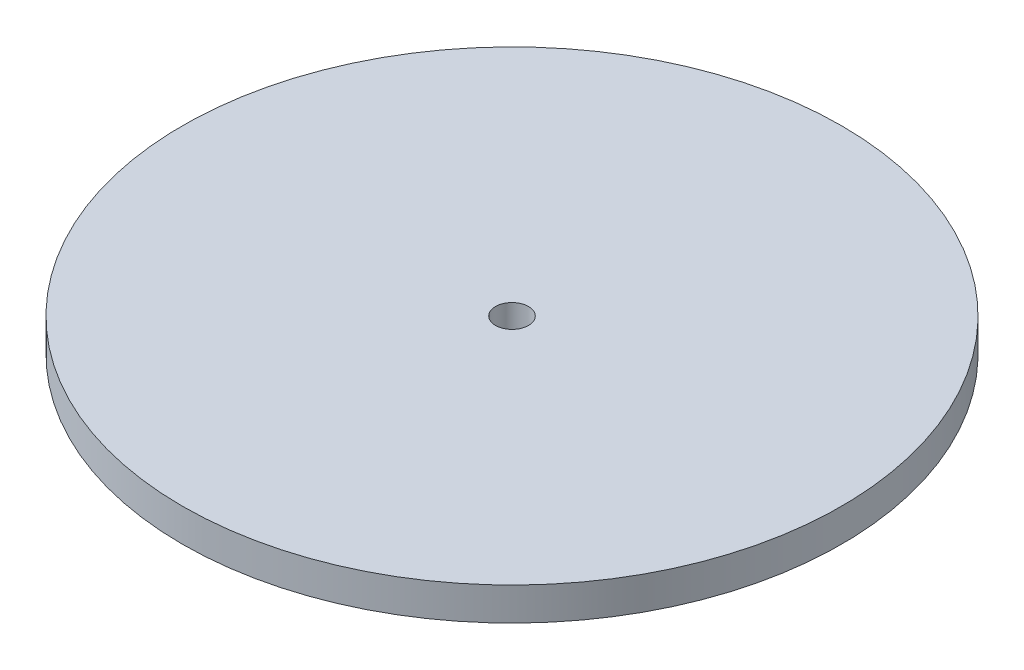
from build123d import *

# Parameters (mm, degrees)
SKETCH1_R      = 63.5
SKETCH1_R_2    = 3.175
EXTRUDE1_DEPTH = 6.35


with BuildPart() as part:
    # Sketch1 → Extrude1 (new body)
    with BuildSketch(Plane(origin=(0, 0, 0), x_dir=(1, 0, 0), z_dir=(0, 1, 0))):
        with Locations(Location((-24.10695154, 6.645700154, 0), (0, 0, 270))):
            Circle(SKETCH1_R)
        with Locations(Location((-24.10695154, 6.645700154, 0), (0, 0, 270))):
            Circle(SKETCH1_R_2, mode=Mode.SUBTRACT)
    extrude(amount=EXTRUDE1_DEPTH)


solid = part.part
